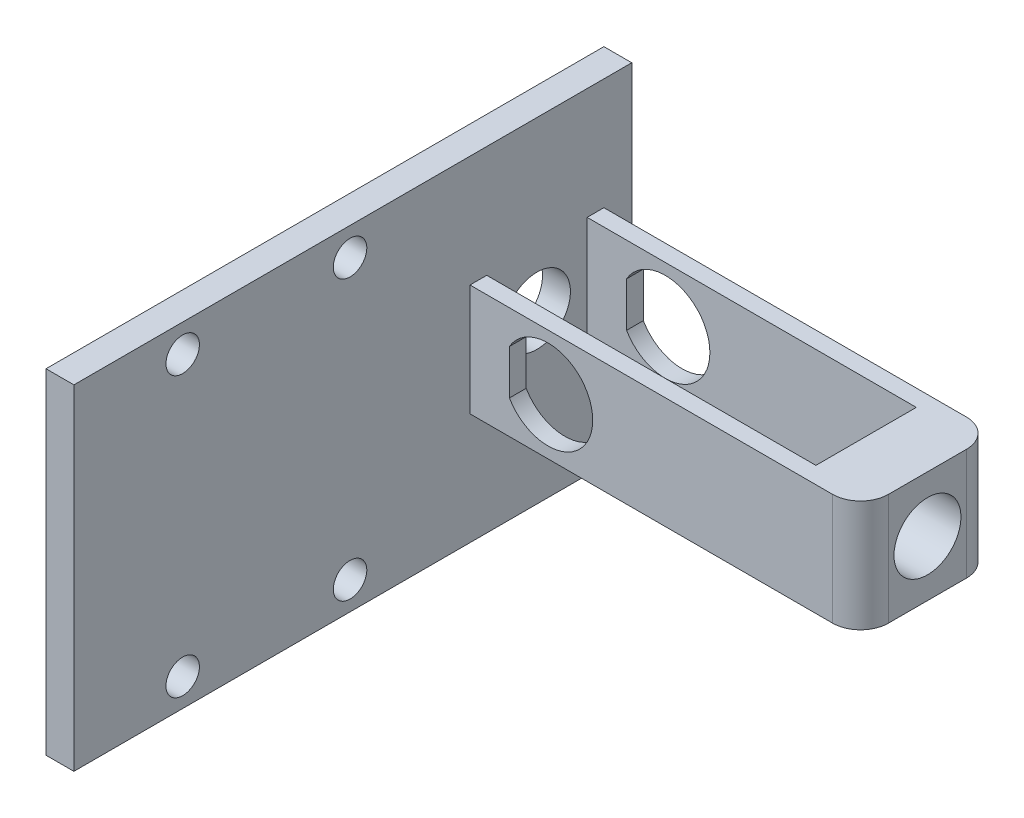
ISO-10303-21;
HEADER;
FILE_DESCRIPTION(('STEP AP214'),'2;1');
FILE_NAME('part.step','',(''),(''),'','','');
FILE_SCHEMA(('AUTOMOTIVE_DESIGN { 1 0 10303 214 1 1 1 1 }'));
ENDSEC;
DATA;
#1=APPLICATION_CONTEXT('core data for automotive mechanical design processes');
#2=APPLICATION_PROTOCOL_DEFINITION('international standard','automotive_design',2000,#1);
#3=PRODUCT_CONTEXT('',#1,'mechanical');
#4=PRODUCT('Part','Part','',(#3));
#5=PRODUCT_RELATED_PRODUCT_CATEGORY('part','',(#4));
#6=PRODUCT_DEFINITION_FORMATION('','',#4);
#7=PRODUCT_DEFINITION_CONTEXT('part definition',#1,'design');
#8=PRODUCT_DEFINITION('design','',#6,#7);
#9=PRODUCT_DEFINITION_SHAPE('','',#8);
#10=(LENGTH_UNIT() NAMED_UNIT(*) SI_UNIT(.MILLI.,.METRE.));
#11=(NAMED_UNIT(*) PLANE_ANGLE_UNIT() SI_UNIT($,.RADIAN.));
#12=(NAMED_UNIT(*) SI_UNIT($,.STERADIAN.) SOLID_ANGLE_UNIT());
#13=UNCERTAINTY_MEASURE_WITH_UNIT(LENGTH_MEASURE(1.E-05),#10,'distance_accuracy_value','');
#14=(GEOMETRIC_REPRESENTATION_CONTEXT(3) GLOBAL_UNCERTAINTY_ASSIGNED_CONTEXT((#13)) GLOBAL_UNIT_ASSIGNED_CONTEXT((#10,
#11,#12)) REPRESENTATION_CONTEXT('',''));
#15=CARTESIAN_POINT('',(0.,0.,0.));
#16=DIRECTION('',(0.,0.,1.));
#17=DIRECTION('',(1.,0.,0.));
#18=AXIS2_PLACEMENT_3D('',#15,#16,#17);
#19=CARTESIAN_POINT('',(35.,-10.,24.));
#20=DIRECTION('',(-1.,0.,0.));
#21=DIRECTION('',(0.,0.,1.));
#22=AXIS2_PLACEMENT_3D('',#19,#20,#21);
#23=PLANE('',#22);
#24=CARTESIAN_POINT('',(35.,0.,12.));
#25=DIRECTION('',(-1.,0.,0.));
#26=DIRECTION('',(0.,0.,1.));
#27=AXIS2_PLACEMENT_3D('',#24,#25,#26);
#28=CIRCLE('',#27,5.99999999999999);
#29=CARTESIAN_POINT('',(35.,0.,18.));
#30=VERTEX_POINT('',#29);
#31=EDGE_CURVE('E197',#30,#30,#28,.T.);
#32=ORIENTED_EDGE('',*,*,#31,.T.);
#33=EDGE_LOOP('',(#32));
#34=FACE_BOUND('',#33,.T.);
#35=DIRECTION('',(0.,0.,-1.));
#36=VECTOR('',#35,1.);
#37=CARTESIAN_POINT('',(35.,-10.,24.));
#38=LINE('',#37,#36);
#39=CARTESIAN_POINT('',(35.,-10.,19.));
#40=VERTEX_POINT('',#39);
#41=CARTESIAN_POINT('',(35.,-10.,5.));
#42=VERTEX_POINT('',#41);
#43=EDGE_CURVE('E276',#40,#42,#38,.T.);
#44=ORIENTED_EDGE('',*,*,#43,.T.);
#45=DIRECTION('',(0.,1.,0.));
#46=VECTOR('',#45,1.);
#47=CARTESIAN_POINT('',(35.,10.,5.));
#48=LINE('',#47,#46);
#49=CARTESIAN_POINT('',(35.,10.,5.));
#50=VERTEX_POINT('',#49);
#51=EDGE_CURVE('E297',#42,#50,#48,.T.);
#52=ORIENTED_EDGE('',*,*,#51,.T.);
#53=DIRECTION('',(0.,0.,-1.));
#54=VECTOR('',#53,1.);
#55=CARTESIAN_POINT('',(35.,10.,24.));
#56=LINE('',#55,#54);
#57=CARTESIAN_POINT('',(35.,10.,19.));
#58=VERTEX_POINT('',#57);
#59=EDGE_CURVE('E292',#58,#50,#56,.T.);
#60=ORIENTED_EDGE('',*,*,#59,.F.);
#61=DIRECTION('',(0.,1.,0.));
#62=VECTOR('',#61,1.);
#63=CARTESIAN_POINT('',(35.,-10.,19.));
#64=LINE('',#63,#62);
#65=EDGE_CURVE('E295',#58,#40,#64,.F.);
#66=ORIENTED_EDGE('',*,*,#65,.T.);
#67=EDGE_LOOP('',(#44,#52,#60,#66));
#68=FACE_BOUND('',#67,.T.);
#69=ADVANCED_FACE('F37',(#34,#68),#23,.F.);
#70=CARTESIAN_POINT('',(-35.,10.,24.));
#71=DIRECTION('',(0.,-1.,0.));
#72=DIRECTION('',(0.,0.,-1.));
#73=AXIS2_PLACEMENT_3D('',#70,#71,#72);
#74=PLANE('',#73);
#75=ORIENTED_EDGE('',*,*,#59,.T.);
#76=CARTESIAN_POINT('',(30.,10.,5.));
#77=DIRECTION('',(0.,-1.,0.));
#78=DIRECTION('',(0.,0.,-1.));
#79=AXIS2_PLACEMENT_3D('',#76,#77,#78);
#80=CIRCLE('',#79,5.);
#81=CARTESIAN_POINT('',(30.,10.,0.));
#82=VERTEX_POINT('',#81);
#83=EDGE_CURVE('E302',#50,#82,#80,.F.);
#84=ORIENTED_EDGE('',*,*,#83,.T.);
#85=DIRECTION('',(-1.,0.,0.));
#86=VECTOR('',#85,1.);
#87=CARTESIAN_POINT('',(-35.,10.,0.));
#88=LINE('',#87,#86);
#89=CARTESIAN_POINT('',(-35.,10.,0.));
#90=VERTEX_POINT('',#89);
#91=EDGE_CURVE('E257',#82,#90,#88,.T.);
#92=ORIENTED_EDGE('',*,*,#91,.T.);
#93=DIRECTION('',(0.,0.,-1.));
#94=VECTOR('',#93,1.);
#95=CARTESIAN_POINT('',(-35.,10.,24.));
#96=LINE('',#95,#94);
#97=CARTESIAN_POINT('',(-35.,10.,3.));
#98=VERTEX_POINT('',#97);
#99=EDGE_CURVE('E289',#98,#90,#96,.T.);
#100=ORIENTED_EDGE('',*,*,#99,.F.);
#101=DIRECTION('',(-1.,0.,0.));
#102=VECTOR('',#101,1.);
#103=CARTESIAN_POINT('',(24.,10.,3.));
#104=LINE('',#103,#102);
#105=CARTESIAN_POINT('',(24.,10.,3.));
#106=VERTEX_POINT('',#105);
#107=EDGE_CURVE('E254',#106,#98,#104,.T.);
#108=ORIENTED_EDGE('',*,*,#107,.F.);
#109=DIRECTION('',(0.,0.,-1.));
#110=VECTOR('',#109,1.);
#111=CARTESIAN_POINT('',(24.,10.,3.));
#112=LINE('',#111,#110);
#113=CARTESIAN_POINT('',(24.,10.,21.));
#114=VERTEX_POINT('',#113);
#115=EDGE_CURVE('E246',#114,#106,#112,.T.);
#116=ORIENTED_EDGE('',*,*,#115,.F.);
#117=DIRECTION('',(-1.,0.,0.));
#118=VECTOR('',#117,1.);
#119=CARTESIAN_POINT('',(24.,10.,21.));
#120=LINE('',#119,#118);
#121=CARTESIAN_POINT('',(-35.,10.,21.));
#122=VERTEX_POINT('',#121);
#123=EDGE_CURVE('E258',#114,#122,#120,.T.);
#124=ORIENTED_EDGE('',*,*,#123,.T.);
#125=CARTESIAN_POINT('',(-35.,10.,24.));
#126=VERTEX_POINT('',#125);
#127=EDGE_CURVE('E290',#126,#122,#96,.T.);
#128=ORIENTED_EDGE('',*,*,#127,.F.);
#129=DIRECTION('',(-1.,0.,0.));
#130=VECTOR('',#129,1.);
#131=CARTESIAN_POINT('',(-35.,10.,24.));
#132=LINE('',#131,#130);
#133=CARTESIAN_POINT('',(30.,10.,24.));
#134=VERTEX_POINT('',#133);
#135=EDGE_CURVE('E266',#134,#126,#132,.T.);
#136=ORIENTED_EDGE('',*,*,#135,.F.);
#137=CARTESIAN_POINT('',(30.,10.,19.));
#138=DIRECTION('',(0.,-1.,0.));
#139=DIRECTION('',(0.,0.,-1.));
#140=AXIS2_PLACEMENT_3D('',#137,#138,#139);
#141=CIRCLE('',#140,5.);
#142=EDGE_CURVE('E300',#134,#58,#141,.F.);
#143=ORIENTED_EDGE('',*,*,#142,.T.);
#144=EDGE_LOOP('',(#75,#84,#92,#100,#108,#116,#124,#128,#136,#143));
#145=FACE_BOUND('',#144,.T.);
#146=ADVANCED_FACE('F324',(#145),#74,.F.);
#147=CARTESIAN_POINT('',(-35.,-10.,24.));
#148=DIRECTION('',(0.,1.,0.));
#149=DIRECTION('',(0.,0.,1.));
#150=AXIS2_PLACEMENT_3D('',#147,#148,#149);
#151=PLANE('',#150);
#152=DIRECTION('',(1.,0.,0.));
#153=VECTOR('',#152,1.);
#154=CARTESIAN_POINT('',(-35.,-10.,0.));
#155=LINE('',#154,#153);
#156=CARTESIAN_POINT('',(-35.,-10.,0.));
#157=VERTEX_POINT('',#156);
#158=CARTESIAN_POINT('',(30.,-10.,0.));
#159=VERTEX_POINT('',#158);
#160=EDGE_CURVE('E270',#157,#159,#155,.T.);
#161=ORIENTED_EDGE('',*,*,#160,.T.);
#162=CARTESIAN_POINT('',(30.,-10.,5.));
#163=DIRECTION('',(0.,1.,0.));
#164=DIRECTION('',(0.,0.,1.));
#165=AXIS2_PLACEMENT_3D('',#162,#163,#164);
#166=CIRCLE('',#165,5.);
#167=EDGE_CURVE('E308',#159,#42,#166,.F.);
#168=ORIENTED_EDGE('',*,*,#167,.T.);
#169=ORIENTED_EDGE('',*,*,#43,.F.);
#170=CARTESIAN_POINT('',(30.,-10.,19.));
#171=DIRECTION('',(0.,1.,0.));
#172=DIRECTION('',(0.,0.,1.));
#173=AXIS2_PLACEMENT_3D('',#170,#171,#172);
#174=CIRCLE('',#173,5.);
#175=CARTESIAN_POINT('',(30.,-10.,24.));
#176=VERTEX_POINT('',#175);
#177=EDGE_CURVE('E306',#40,#176,#174,.F.);
#178=ORIENTED_EDGE('',*,*,#177,.T.);
#179=DIRECTION('',(1.,0.,0.));
#180=VECTOR('',#179,1.);
#181=CARTESIAN_POINT('',(-35.,-10.,24.));
#182=LINE('',#181,#180);
#183=CARTESIAN_POINT('',(-35.,-10.,24.));
#184=VERTEX_POINT('',#183);
#185=EDGE_CURVE('E273',#184,#176,#182,.T.);
#186=ORIENTED_EDGE('',*,*,#185,.F.);
#187=DIRECTION('',(0.,0.,-1.));
#188=VECTOR('',#187,1.);
#189=CARTESIAN_POINT('',(-35.,-10.,24.));
#190=LINE('',#189,#188);
#191=CARTESIAN_POINT('',(-35.,-10.,21.));
#192=VERTEX_POINT('',#191);
#193=EDGE_CURVE('E286',#184,#192,#190,.T.);
#194=ORIENTED_EDGE('',*,*,#193,.T.);
#195=DIRECTION('',(-1.,0.,0.));
#196=VECTOR('',#195,1.);
#197=CARTESIAN_POINT('',(24.,-10.,21.));
#198=LINE('',#197,#196);
#199=CARTESIAN_POINT('',(24.,-10.,21.));
#200=VERTEX_POINT('',#199);
#201=EDGE_CURVE('E261',#200,#192,#198,.T.);
#202=ORIENTED_EDGE('',*,*,#201,.F.);
#203=DIRECTION('',(0.,0.,1.));
#204=VECTOR('',#203,1.);
#205=CARTESIAN_POINT('',(24.,-10.,3.));
#206=LINE('',#205,#204);
#207=CARTESIAN_POINT('',(24.,-10.,3.));
#208=VERTEX_POINT('',#207);
#209=EDGE_CURVE('E239',#208,#200,#206,.T.);
#210=ORIENTED_EDGE('',*,*,#209,.F.);
#211=DIRECTION('',(-1.,0.,0.));
#212=VECTOR('',#211,1.);
#213=CARTESIAN_POINT('',(24.,-10.,3.));
#214=LINE('',#213,#212);
#215=CARTESIAN_POINT('',(-35.,-10.,3.));
#216=VERTEX_POINT('',#215);
#217=EDGE_CURVE('E249',#208,#216,#214,.T.);
#218=ORIENTED_EDGE('',*,*,#217,.T.);
#219=EDGE_CURVE('E285',#216,#157,#190,.T.);
#220=ORIENTED_EDGE('',*,*,#219,.T.);
#221=EDGE_LOOP('',(#161,#168,#169,#178,#186,#194,#202,#210,#218,#220));
#222=FACE_BOUND('',#221,.T.);
#223=ADVANCED_FACE('F332',(#222),#151,.F.);
#224=CARTESIAN_POINT('',(0.,0.,24.));
#225=DIRECTION('',(0.,0.,-1.));
#226=DIRECTION('',(-1.,0.,0.));
#227=AXIS2_PLACEMENT_3D('',#224,#225,#226);
#228=PLANE('',#227);
#229=DIRECTION('',(0.,-1.,0.));
#230=VECTOR('',#229,1.);
#231=CARTESIAN_POINT('',(-27.9282032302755,4.,24.));
#232=LINE('',#231,#230);
#233=CARTESIAN_POINT('',(-27.9282032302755,4.,24.));
#234=VERTEX_POINT('',#233);
#235=CARTESIAN_POINT('',(-27.9282032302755,-4.,24.));
#236=VERTEX_POINT('',#235);
#237=EDGE_CURVE('E169',#234,#236,#232,.T.);
#238=ORIENTED_EDGE('',*,*,#237,.F.);
#239=CARTESIAN_POINT('',(-21.,0.,24.));
#240=DIRECTION('',(0.,0.,1.));
#241=DIRECTION('',(1.,0.,0.));
#242=AXIS2_PLACEMENT_3D('',#239,#240,#241);
#243=CIRCLE('',#242,8.);
#244=EDGE_CURVE('E52',#236,#234,#243,.T.);
#245=ORIENTED_EDGE('',*,*,#244,.F.);
#246=EDGE_LOOP('',(#238,#245));
#247=FACE_BOUND('',#246,.T.);
#248=ORIENTED_EDGE('',*,*,#185,.T.);
#249=DIRECTION('',(0.,1.,0.));
#250=VECTOR('',#249,1.);
#251=CARTESIAN_POINT('',(30.,0.,24.));
#252=LINE('',#251,#250);
#253=EDGE_CURVE('E310',#176,#134,#252,.T.);
#254=ORIENTED_EDGE('',*,*,#253,.T.);
#255=ORIENTED_EDGE('',*,*,#135,.T.);
#256=DIRECTION('',(0.,-1.,0.));
#257=VECTOR('',#256,1.);
#258=CARTESIAN_POINT('',(-35.,-10.,24.));
#259=LINE('',#258,#257);
#260=EDGE_CURVE('E269',#126,#184,#259,.T.);
#261=ORIENTED_EDGE('',*,*,#260,.T.);
#262=EDGE_LOOP('',(#248,#254,#255,#261));
#263=FACE_BOUND('',#262,.T.);
#264=ADVANCED_FACE('F174',(#247,#263),#228,.F.);
#265=CARTESIAN_POINT('',(0.,0.,0.));
#266=DIRECTION('',(0.,0.,-1.));
#267=DIRECTION('',(-1.,0.,0.));
#268=AXIS2_PLACEMENT_3D('',#265,#266,#267);
#269=PLANE('',#268);
#270=CARTESIAN_POINT('',(-21.,0.,0.));
#271=DIRECTION('',(0.,0.,-1.));
#272=DIRECTION('',(-1.,0.,0.));
#273=AXIS2_PLACEMENT_3D('',#270,#271,#272);
#274=CIRCLE('',#273,8.);
#275=CARTESIAN_POINT('',(-27.9282032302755,4.,0.));
#276=VERTEX_POINT('',#275);
#277=CARTESIAN_POINT('',(-27.9282032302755,-4.,0.));
#278=VERTEX_POINT('',#277);
#279=EDGE_CURVE('E192',#276,#278,#274,.T.);
#280=ORIENTED_EDGE('',*,*,#279,.F.);
#281=DIRECTION('',(0.,1.,0.));
#282=VECTOR('',#281,1.);
#283=CARTESIAN_POINT('',(-27.9282032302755,0.,0.));
#284=LINE('',#283,#282);
#285=EDGE_CURVE('E187',#278,#276,#284,.T.);
#286=ORIENTED_EDGE('',*,*,#285,.F.);
#287=EDGE_LOOP('',(#280,#286));
#288=FACE_BOUND('',#287,.T.);
#289=ORIENTED_EDGE('',*,*,#91,.F.);
#290=DIRECTION('',(0.,1.,0.));
#291=VECTOR('',#290,1.);
#292=CARTESIAN_POINT('',(30.,-10.,0.));
#293=LINE('',#292,#291);
#294=EDGE_CURVE('E304',#82,#159,#293,.F.);
#295=ORIENTED_EDGE('',*,*,#294,.T.);
#296=ORIENTED_EDGE('',*,*,#160,.F.);
#297=DIRECTION('',(0.,-1.,0.));
#298=VECTOR('',#297,1.);
#299=CARTESIAN_POINT('',(-35.,-10.,0.));
#300=LINE('',#299,#298);
#301=EDGE_CURVE('E279',#90,#157,#300,.T.);
#302=ORIENTED_EDGE('',*,*,#301,.F.);
#303=EDGE_LOOP('',(#289,#295,#296,#302));
#304=FACE_BOUND('',#303,.T.);
#305=ADVANCED_FACE('F350',(#288,#304),#269,.T.);
#306=CARTESIAN_POINT('',(24.,10.,3.));
#307=DIRECTION('',(0.,0.,-1.));
#308=DIRECTION('',(0.,1.,0.));
#309=AXIS2_PLACEMENT_3D('',#306,#307,#308);
#310=PLANE('',#309);
#311=DIRECTION('',(0.,1.,0.));
#312=VECTOR('',#311,1.);
#313=CARTESIAN_POINT('',(-27.9282032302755,10.,3.));
#314=LINE('',#313,#312);
#315=CARTESIAN_POINT('',(-27.9282032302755,-4.,3.));
#316=VERTEX_POINT('',#315);
#317=CARTESIAN_POINT('',(-27.9282032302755,4.,3.));
#318=VERTEX_POINT('',#317);
#319=EDGE_CURVE('E184',#316,#318,#314,.T.);
#320=ORIENTED_EDGE('',*,*,#319,.T.);
#321=CARTESIAN_POINT('',(-21.,0.,3.));
#322=DIRECTION('',(0.,0.,-1.));
#323=DIRECTION('',(0.,1.,0.));
#324=AXIS2_PLACEMENT_3D('',#321,#322,#323);
#325=CIRCLE('',#324,8.);
#326=EDGE_CURVE('E189',#318,#316,#325,.T.);
#327=ORIENTED_EDGE('',*,*,#326,.T.);
#328=EDGE_LOOP('',(#320,#327));
#329=FACE_BOUND('',#328,.T.);
#330=DIRECTION('',(0.,-1.,0.));
#331=VECTOR('',#330,1.);
#332=CARTESIAN_POINT('',(-35.,10.,3.));
#333=LINE('',#332,#331);
#334=EDGE_CURVE('E236',#98,#216,#333,.T.);
#335=ORIENTED_EDGE('',*,*,#334,.T.);
#336=ORIENTED_EDGE('',*,*,#217,.F.);
#337=DIRECTION('',(0.,-1.,0.));
#338=VECTOR('',#337,1.);
#339=CARTESIAN_POINT('',(24.,10.,3.));
#340=LINE('',#339,#338);
#341=EDGE_CURVE('E237',#106,#208,#340,.T.);
#342=ORIENTED_EDGE('',*,*,#341,.F.);
#343=ORIENTED_EDGE('',*,*,#107,.T.);
#344=EDGE_LOOP('',(#335,#336,#342,#343));
#345=FACE_BOUND('',#344,.T.);
#346=ADVANCED_FACE('F317',(#329,#345),#310,.F.);
#347=CARTESIAN_POINT('',(24.,10.,21.));
#348=DIRECTION('',(0.,0.,1.));
#349=DIRECTION('',(0.,-1.,0.));
#350=AXIS2_PLACEMENT_3D('',#347,#348,#349);
#351=PLANE('',#350);
#352=DIRECTION('',(0.,-1.,0.));
#353=VECTOR('',#352,1.);
#354=CARTESIAN_POINT('',(-27.9282032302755,10.,21.));
#355=LINE('',#354,#353);
#356=CARTESIAN_POINT('',(-27.9282032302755,4.,21.));
#357=VERTEX_POINT('',#356);
#358=CARTESIAN_POINT('',(-27.9282032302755,-4.,21.));
#359=VERTEX_POINT('',#358);
#360=EDGE_CURVE('E45',#357,#359,#355,.T.);
#361=ORIENTED_EDGE('',*,*,#360,.T.);
#362=CARTESIAN_POINT('',(-21.,0.,21.));
#363=DIRECTION('',(0.,0.,1.));
#364=DIRECTION('',(0.,-1.,0.));
#365=AXIS2_PLACEMENT_3D('',#362,#363,#364);
#366=CIRCLE('',#365,8.);
#367=EDGE_CURVE('E11',#359,#357,#366,.T.);
#368=ORIENTED_EDGE('',*,*,#367,.T.);
#369=EDGE_LOOP('',(#361,#368));
#370=FACE_BOUND('',#369,.T.);
#371=DIRECTION('',(0.,1.,0.));
#372=VECTOR('',#371,1.);
#373=CARTESIAN_POINT('',(-35.,10.,21.));
#374=LINE('',#373,#372);
#375=EDGE_CURVE('E240',#192,#122,#374,.T.);
#376=ORIENTED_EDGE('',*,*,#375,.T.);
#377=ORIENTED_EDGE('',*,*,#123,.F.);
#378=DIRECTION('',(0.,1.,0.));
#379=VECTOR('',#378,1.);
#380=CARTESIAN_POINT('',(24.,10.,21.));
#381=LINE('',#380,#379);
#382=EDGE_CURVE('E243',#200,#114,#381,.T.);
#383=ORIENTED_EDGE('',*,*,#382,.F.);
#384=ORIENTED_EDGE('',*,*,#201,.T.);
#385=EDGE_LOOP('',(#376,#377,#383,#384));
#386=FACE_BOUND('',#385,.T.);
#387=ADVANCED_FACE('F313',(#370,#386),#351,.F.);
#388=CARTESIAN_POINT('',(24.,0.,0.));
#389=DIRECTION('',(-1.,0.,0.));
#390=DIRECTION('',(0.,0.,1.));
#391=AXIS2_PLACEMENT_3D('',#388,#389,#390);
#392=PLANE('',#391);
#393=CARTESIAN_POINT('',(24.,0.,12.));
#394=DIRECTION('',(-1.,0.,0.));
#395=DIRECTION('',(0.,0.,1.));
#396=AXIS2_PLACEMENT_3D('',#393,#394,#395);
#397=CIRCLE('',#396,5.99999999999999);
#398=CARTESIAN_POINT('',(24.,0.,18.));
#399=VERTEX_POINT('',#398);
#400=EDGE_CURVE('E203',#399,#399,#397,.T.);
#401=ORIENTED_EDGE('',*,*,#400,.F.);
#402=EDGE_LOOP('',(#401));
#403=FACE_BOUND('',#402,.T.);
#404=ORIENTED_EDGE('',*,*,#341,.T.);
#405=ORIENTED_EDGE('',*,*,#209,.T.);
#406=ORIENTED_EDGE('',*,*,#382,.T.);
#407=ORIENTED_EDGE('',*,*,#115,.T.);
#408=EDGE_LOOP('',(#404,#405,#406,#407));
#409=FACE_BOUND('',#408,.T.);
#410=ADVANCED_FACE('F316',(#403,#409),#392,.T.);
#411=CARTESIAN_POINT('',(30.,-10.,5.));
#412=DIRECTION('',(0.,-1.,0.));
#413=DIRECTION('',(0.,0.,-1.));
#414=AXIS2_PLACEMENT_3D('',#411,#412,#413);
#415=CYLINDRICAL_SURFACE('',#414,5.);
#416=ORIENTED_EDGE('',*,*,#167,.F.);
#417=ORIENTED_EDGE('',*,*,#294,.F.);
#418=ORIENTED_EDGE('',*,*,#83,.F.);
#419=ORIENTED_EDGE('',*,*,#51,.F.);
#420=EDGE_LOOP('',(#416,#417,#418,#419));
#421=FACE_BOUND('',#420,.T.);
#422=ADVANCED_FACE('F345',(#421),#415,.T.);
#423=CARTESIAN_POINT('',(30.,0.,19.));
#424=DIRECTION('',(0.,1.,0.));
#425=DIRECTION('',(0.,0.,1.));
#426=AXIS2_PLACEMENT_3D('',#423,#424,#425);
#427=CYLINDRICAL_SURFACE('',#426,5.);
#428=ORIENTED_EDGE('',*,*,#177,.F.);
#429=ORIENTED_EDGE('',*,*,#65,.F.);
#430=ORIENTED_EDGE('',*,*,#142,.F.);
#431=ORIENTED_EDGE('',*,*,#253,.F.);
#432=EDGE_LOOP('',(#428,#429,#430,#431));
#433=FACE_BOUND('',#432,.T.);
#434=ADVANCED_FACE('F39',(#433),#427,.T.);
#435=CARTESIAN_POINT('',(-35.,0.,0.));
#436=DIRECTION('',(-1.,0.,0.));
#437=DIRECTION('',(0.,0.,1.));
#438=AXIS2_PLACEMENT_3D('',#435,#436,#437);
#439=PLANE('',#438);
#440=CARTESIAN_POINT('',(-35.,-25.,45.5));
#441=DIRECTION('',(-1.,0.,0.));
#442=DIRECTION('',(0.,0.,1.));
#443=AXIS2_PLACEMENT_3D('',#440,#441,#442);
#444=CIRCLE('',#443,3.);
#445=CARTESIAN_POINT('',(-35.,-25.,48.5));
#446=VERTEX_POINT('',#445);
#447=EDGE_CURVE('E440',#446,#446,#444,.T.);
#448=ORIENTED_EDGE('',*,*,#447,.T.);
#449=EDGE_LOOP('',(#448));
#450=FACE_BOUND('',#449,.T.);
#451=CARTESIAN_POINT('',(-35.,-25.,75.5));
#452=DIRECTION('',(-1.,0.,0.));
#453=DIRECTION('',(0.,0.,1.));
#454=AXIS2_PLACEMENT_3D('',#451,#452,#453);
#455=CIRCLE('',#454,3.);
#456=CARTESIAN_POINT('',(-35.,-25.,78.5));
#457=VERTEX_POINT('',#456);
#458=EDGE_CURVE('E450',#457,#457,#455,.T.);
#459=ORIENTED_EDGE('',*,*,#458,.T.);
#460=EDGE_LOOP('',(#459));
#461=FACE_BOUND('',#460,.T.);
#462=CARTESIAN_POINT('',(-35.,25.,75.5));
#463=DIRECTION('',(-1.,0.,0.));
#464=DIRECTION('',(0.,0.,1.));
#465=AXIS2_PLACEMENT_3D('',#462,#463,#464);
#466=CIRCLE('',#465,3.);
#467=CARTESIAN_POINT('',(-35.,25.,78.5));
#468=VERTEX_POINT('',#467);
#469=EDGE_CURVE('E456',#468,#468,#466,.T.);
#470=ORIENTED_EDGE('',*,*,#469,.T.);
#471=EDGE_LOOP('',(#470));
#472=FACE_BOUND('',#471,.T.);
#473=CARTESIAN_POINT('',(-35.,25.,45.5));
#474=DIRECTION('',(-1.,0.,0.));
#475=DIRECTION('',(0.,0.,1.));
#476=AXIS2_PLACEMENT_3D('',#473,#474,#475);
#477=CIRCLE('',#476,3.);
#478=CARTESIAN_POINT('',(-35.,25.,48.5));
#479=VERTEX_POINT('',#478);
#480=EDGE_CURVE('E176',#479,#479,#477,.T.);
#481=ORIENTED_EDGE('',*,*,#480,.T.);
#482=EDGE_LOOP('',(#481));
#483=FACE_BOUND('',#482,.T.);
#484=CARTESIAN_POINT('',(-35.,0.,12.));
#485=DIRECTION('',(-1.,0.,0.));
#486=DIRECTION('',(0.,0.,1.));
#487=AXIS2_PLACEMENT_3D('',#484,#485,#486);
#488=CIRCLE('',#487,5.99999999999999);
#489=CARTESIAN_POINT('',(-35.,0.,18.));
#490=VERTEX_POINT('',#489);
#491=EDGE_CURVE('E200',#490,#490,#488,.T.);
#492=ORIENTED_EDGE('',*,*,#491,.T.);
#493=EDGE_LOOP('',(#492));
#494=FACE_BOUND('',#493,.T.);
#495=ORIENTED_EDGE('',*,*,#301,.T.);
#496=ORIENTED_EDGE('',*,*,#219,.F.);
#497=ORIENTED_EDGE('',*,*,#334,.F.);
#498=ORIENTED_EDGE('',*,*,#99,.T.);
#499=EDGE_LOOP('',(#495,#496,#497,#498));
#500=FACE_BOUND('',#499,.T.);
#501=DIRECTION('',(0.,-1.,0.));
#502=VECTOR('',#501,1.);
#503=CARTESIAN_POINT('',(-35.,30.,-5.));
#504=LINE('',#503,#502);
#505=CARTESIAN_POINT('',(-35.,30.,-5.));
#506=VERTEX_POINT('',#505);
#507=CARTESIAN_POINT('',(-35.,-30.,-5.));
#508=VERTEX_POINT('',#507);
#509=EDGE_CURVE('E206',#506,#508,#504,.T.);
#510=ORIENTED_EDGE('',*,*,#509,.F.);
#511=DIRECTION('',(0.,0.,-1.));
#512=VECTOR('',#511,1.);
#513=CARTESIAN_POINT('',(-35.,30.,-5.));
#514=LINE('',#513,#512);
#515=CARTESIAN_POINT('',(-35.,30.,95.));
#516=VERTEX_POINT('',#515);
#517=EDGE_CURVE('E211',#516,#506,#514,.T.);
#518=ORIENTED_EDGE('',*,*,#517,.F.);
#519=DIRECTION('',(0.,1.,0.));
#520=VECTOR('',#519,1.);
#521=CARTESIAN_POINT('',(-35.,30.,95.));
#522=LINE('',#521,#520);
#523=CARTESIAN_POINT('',(-35.,-30.,95.));
#524=VERTEX_POINT('',#523);
#525=EDGE_CURVE('E222',#524,#516,#522,.T.);
#526=ORIENTED_EDGE('',*,*,#525,.F.);
#527=DIRECTION('',(0.,0.,1.));
#528=VECTOR('',#527,1.);
#529=CARTESIAN_POINT('',(-35.,-30.,-5.));
#530=LINE('',#529,#528);
#531=EDGE_CURVE('E220',#508,#524,#530,.T.);
#532=ORIENTED_EDGE('',*,*,#531,.F.);
#533=EDGE_LOOP('',(#510,#518,#526,#532));
#534=FACE_BOUND('',#533,.T.);
#535=ORIENTED_EDGE('',*,*,#193,.F.);
#536=ORIENTED_EDGE('',*,*,#260,.F.);
#537=ORIENTED_EDGE('',*,*,#127,.T.);
#538=ORIENTED_EDGE('',*,*,#375,.F.);
#539=EDGE_LOOP('',(#535,#536,#537,#538));
#540=FACE_BOUND('',#539,.T.);
#541=ADVANCED_FACE('F334',(#450,#461,#472,#483,#494,#500,#534,#540),#439,.F.);
#542=CARTESIAN_POINT('',(-40.,30.,-5.));
#543=DIRECTION('',(0.,0.,1.));
#544=DIRECTION('',(1.,0.,0.));
#545=AXIS2_PLACEMENT_3D('',#542,#543,#544);
#546=PLANE('',#545);
#547=ORIENTED_EDGE('',*,*,#509,.T.);
#548=DIRECTION('',(1.,0.,0.));
#549=VECTOR('',#548,1.);
#550=CARTESIAN_POINT('',(-40.,-30.,-5.));
#551=LINE('',#550,#549);
#552=CARTESIAN_POINT('',(-40.,-30.,-5.));
#553=VERTEX_POINT('',#552);
#554=EDGE_CURVE('E233',#553,#508,#551,.T.);
#555=ORIENTED_EDGE('',*,*,#554,.F.);
#556=DIRECTION('',(0.,-1.,0.));
#557=VECTOR('',#556,1.);
#558=CARTESIAN_POINT('',(-40.,30.,-5.));
#559=LINE('',#558,#557);
#560=CARTESIAN_POINT('',(-40.,30.,-5.));
#561=VERTEX_POINT('',#560);
#562=EDGE_CURVE('E207',#561,#553,#559,.T.);
#563=ORIENTED_EDGE('',*,*,#562,.F.);
#564=DIRECTION('',(1.,0.,0.));
#565=VECTOR('',#564,1.);
#566=CARTESIAN_POINT('',(-40.,30.,-5.));
#567=LINE('',#566,#565);
#568=EDGE_CURVE('E217',#561,#506,#567,.T.);
#569=ORIENTED_EDGE('',*,*,#568,.T.);
#570=EDGE_LOOP('',(#547,#555,#563,#569));
#571=FACE_BOUND('',#570,.T.);
#572=ADVANCED_FACE('F386',(#571),#546,.F.);
#573=CARTESIAN_POINT('',(-40.,-30.,-5.));
#574=DIRECTION('',(0.,1.,0.));
#575=DIRECTION('',(0.,0.,1.));
#576=AXIS2_PLACEMENT_3D('',#573,#574,#575);
#577=PLANE('',#576);
#578=ORIENTED_EDGE('',*,*,#531,.T.);
#579=DIRECTION('',(1.,0.,0.));
#580=VECTOR('',#579,1.);
#581=CARTESIAN_POINT('',(-40.,-30.,95.));
#582=LINE('',#581,#580);
#583=CARTESIAN_POINT('',(-40.,-30.,95.));
#584=VERTEX_POINT('',#583);
#585=EDGE_CURVE('E230',#584,#524,#582,.T.);
#586=ORIENTED_EDGE('',*,*,#585,.F.);
#587=DIRECTION('',(0.,0.,1.));
#588=VECTOR('',#587,1.);
#589=CARTESIAN_POINT('',(-40.,-30.,-5.));
#590=LINE('',#589,#588);
#591=EDGE_CURVE('E210',#553,#584,#590,.T.);
#592=ORIENTED_EDGE('',*,*,#591,.F.);
#593=ORIENTED_EDGE('',*,*,#554,.T.);
#594=EDGE_LOOP('',(#578,#586,#592,#593));
#595=FACE_BOUND('',#594,.T.);
#596=ADVANCED_FACE('F389',(#595),#577,.F.);
#597=CARTESIAN_POINT('',(-40.,30.,95.));
#598=DIRECTION('',(0.,0.,-1.));
#599=DIRECTION('',(-1.,0.,0.));
#600=AXIS2_PLACEMENT_3D('',#597,#598,#599);
#601=PLANE('',#600);
#602=ORIENTED_EDGE('',*,*,#525,.T.);
#603=DIRECTION('',(1.,0.,0.));
#604=VECTOR('',#603,1.);
#605=CARTESIAN_POINT('',(-40.,30.,95.));
#606=LINE('',#605,#604);
#607=CARTESIAN_POINT('',(-40.,30.,95.));
#608=VERTEX_POINT('',#607);
#609=EDGE_CURVE('E227',#608,#516,#606,.T.);
#610=ORIENTED_EDGE('',*,*,#609,.F.);
#611=DIRECTION('',(0.,1.,0.));
#612=VECTOR('',#611,1.);
#613=CARTESIAN_POINT('',(-40.,30.,95.));
#614=LINE('',#613,#612);
#615=EDGE_CURVE('E213',#584,#608,#614,.T.);
#616=ORIENTED_EDGE('',*,*,#615,.F.);
#617=ORIENTED_EDGE('',*,*,#585,.T.);
#618=EDGE_LOOP('',(#602,#610,#616,#617));
#619=FACE_BOUND('',#618,.T.);
#620=ADVANCED_FACE('F393',(#619),#601,.F.);
#621=CARTESIAN_POINT('',(-40.,30.,-5.));
#622=DIRECTION('',(0.,-1.,0.));
#623=DIRECTION('',(0.,0.,-1.));
#624=AXIS2_PLACEMENT_3D('',#621,#622,#623);
#625=PLANE('',#624);
#626=ORIENTED_EDGE('',*,*,#517,.T.);
#627=ORIENTED_EDGE('',*,*,#568,.F.);
#628=DIRECTION('',(0.,0.,-1.));
#629=VECTOR('',#628,1.);
#630=CARTESIAN_POINT('',(-40.,30.,-5.));
#631=LINE('',#630,#629);
#632=EDGE_CURVE('E215',#608,#561,#631,.T.);
#633=ORIENTED_EDGE('',*,*,#632,.F.);
#634=ORIENTED_EDGE('',*,*,#609,.T.);
#635=EDGE_LOOP('',(#626,#627,#633,#634));
#636=FACE_BOUND('',#635,.T.);
#637=ADVANCED_FACE('F397',(#636),#625,.F.);
#638=CARTESIAN_POINT('',(-40.,0.,0.));
#639=DIRECTION('',(-1.,0.,0.));
#640=DIRECTION('',(0.,0.,1.));
#641=AXIS2_PLACEMENT_3D('',#638,#639,#640);
#642=PLANE('',#641);
#643=CARTESIAN_POINT('',(-40.,-25.,45.5));
#644=DIRECTION('',(-1.,0.,0.));
#645=DIRECTION('',(0.,0.,1.));
#646=AXIS2_PLACEMENT_3D('',#643,#644,#645);
#647=CIRCLE('',#646,3.);
#648=CARTESIAN_POINT('',(-40.,-25.,48.5));
#649=VERTEX_POINT('',#648);
#650=EDGE_CURVE('E443',#649,#649,#647,.T.);
#651=ORIENTED_EDGE('',*,*,#650,.F.);
#652=EDGE_LOOP('',(#651));
#653=FACE_BOUND('',#652,.T.);
#654=CARTESIAN_POINT('',(-40.,-25.,75.5));
#655=DIRECTION('',(-1.,0.,0.));
#656=DIRECTION('',(0.,0.,1.));
#657=AXIS2_PLACEMENT_3D('',#654,#655,#656);
#658=CIRCLE('',#657,3.);
#659=CARTESIAN_POINT('',(-40.,-25.,78.5));
#660=VERTEX_POINT('',#659);
#661=EDGE_CURVE('E445',#660,#660,#658,.T.);
#662=ORIENTED_EDGE('',*,*,#661,.F.);
#663=EDGE_LOOP('',(#662));
#664=FACE_BOUND('',#663,.T.);
#665=CARTESIAN_POINT('',(-40.,25.,75.5));
#666=DIRECTION('',(-1.,0.,0.));
#667=DIRECTION('',(0.,0.,1.));
#668=AXIS2_PLACEMENT_3D('',#665,#666,#667);
#669=CIRCLE('',#668,3.);
#670=CARTESIAN_POINT('',(-40.,25.,78.5));
#671=VERTEX_POINT('',#670);
#672=EDGE_CURVE('E453',#671,#671,#669,.T.);
#673=ORIENTED_EDGE('',*,*,#672,.F.);
#674=EDGE_LOOP('',(#673));
#675=FACE_BOUND('',#674,.T.);
#676=CARTESIAN_POINT('',(-40.,25.,45.5));
#677=DIRECTION('',(-1.,0.,0.));
#678=DIRECTION('',(0.,0.,1.));
#679=AXIS2_PLACEMENT_3D('',#676,#677,#678);
#680=CIRCLE('',#679,3.);
#681=CARTESIAN_POINT('',(-40.,25.,48.5));
#682=VERTEX_POINT('',#681);
#683=EDGE_CURVE('E179',#682,#682,#680,.T.);
#684=ORIENTED_EDGE('',*,*,#683,.F.);
#685=EDGE_LOOP('',(#684));
#686=FACE_BOUND('',#685,.T.);
#687=CARTESIAN_POINT('',(-40.,0.,12.));
#688=DIRECTION('',(-1.,0.,0.));
#689=DIRECTION('',(0.,0.,1.));
#690=AXIS2_PLACEMENT_3D('',#687,#688,#689);
#691=CIRCLE('',#690,5.99999999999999);
#692=CARTESIAN_POINT('',(-40.,0.,18.));
#693=VERTEX_POINT('',#692);
#694=EDGE_CURVE('E194',#693,#693,#691,.T.);
#695=ORIENTED_EDGE('',*,*,#694,.F.);
#696=EDGE_LOOP('',(#695));
#697=FACE_BOUND('',#696,.T.);
#698=ORIENTED_EDGE('',*,*,#562,.T.);
#699=ORIENTED_EDGE('',*,*,#591,.T.);
#700=ORIENTED_EDGE('',*,*,#615,.T.);
#701=ORIENTED_EDGE('',*,*,#632,.T.);
#702=EDGE_LOOP('',(#698,#699,#700,#701));
#703=FACE_BOUND('',#702,.T.);
#704=ADVANCED_FACE('F400',(#653,#664,#675,#686,#697,#703),#642,.T.);
#705=CARTESIAN_POINT('',(35.,0.,12.));
#706=DIRECTION('',(-1.,0.,0.));
#707=DIRECTION('',(0.,0.,1.));
#708=AXIS2_PLACEMENT_3D('',#705,#706,#707);
#709=CYLINDRICAL_SURFACE('',#708,5.99999999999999);
#710=ORIENTED_EDGE('',*,*,#694,.T.);
#711=EDGE_LOOP('',(#710));
#712=FACE_BOUND('',#711,.T.);
#713=ORIENTED_EDGE('',*,*,#491,.F.);
#714=EDGE_LOOP('',(#713));
#715=FACE_BOUND('',#714,.T.);
#716=ADVANCED_FACE('F407',(#712,#715),#709,.F.);
#717=ORIENTED_EDGE('',*,*,#400,.T.);
#718=EDGE_LOOP('',(#717));
#719=FACE_BOUND('',#718,.T.);
#720=ORIENTED_EDGE('',*,*,#31,.F.);
#721=EDGE_LOOP('',(#720));
#722=FACE_BOUND('',#721,.T.);
#723=ADVANCED_FACE('F409',(#719,#722),#709,.F.);
#724=CARTESIAN_POINT('',(-27.9282032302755,4.,-5.));
#725=DIRECTION('',(-1.,0.,0.));
#726=DIRECTION('',(0.,0.,1.));
#727=AXIS2_PLACEMENT_3D('',#724,#725,#726);
#728=PLANE('',#727);
#729=DIRECTION('',(0.,0.,1.));
#730=VECTOR('',#729,1.);
#731=CARTESIAN_POINT('',(-27.9282032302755,4.,-5.));
#732=LINE('',#731,#730);
#733=EDGE_CURVE('E171',#357,#234,#732,.T.);
#734=ORIENTED_EDGE('',*,*,#733,.T.);
#735=ORIENTED_EDGE('',*,*,#237,.T.);
#736=DIRECTION('',(0.,0.,1.));
#737=VECTOR('',#736,1.);
#738=CARTESIAN_POINT('',(-27.9282032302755,-4.,-5.));
#739=LINE('',#738,#737);
#740=EDGE_CURVE('E161',#359,#236,#739,.T.);
#741=ORIENTED_EDGE('',*,*,#740,.F.);
#742=ORIENTED_EDGE('',*,*,#360,.F.);
#743=EDGE_LOOP('',(#734,#735,#741,#742));
#744=FACE_BOUND('',#743,.T.);
#745=ADVANCED_FACE('F170',(#744),#728,.F.);
#746=CARTESIAN_POINT('',(-21.,0.,-5.));
#747=DIRECTION('',(0.,0.,1.));
#748=DIRECTION('',(1.,0.,0.));
#749=AXIS2_PLACEMENT_3D('',#746,#747,#748);
#750=CYLINDRICAL_SURFACE('',#749,8.);
#751=ORIENTED_EDGE('',*,*,#740,.T.);
#752=ORIENTED_EDGE('',*,*,#244,.T.);
#753=ORIENTED_EDGE('',*,*,#733,.F.);
#754=ORIENTED_EDGE('',*,*,#367,.F.);
#755=EDGE_LOOP('',(#751,#752,#753,#754));
#756=FACE_BOUND('',#755,.T.);
#757=ADVANCED_FACE('F163',(#756),#750,.F.);
#758=ORIENTED_EDGE('',*,*,#279,.T.);
#759=EDGE_CURVE('E60',#278,#316,#739,.T.);
#760=ORIENTED_EDGE('',*,*,#759,.T.);
#761=ORIENTED_EDGE('',*,*,#326,.F.);
#762=EDGE_CURVE('E166',#276,#318,#732,.T.);
#763=ORIENTED_EDGE('',*,*,#762,.F.);
#764=EDGE_LOOP('',(#758,#760,#761,#763));
#765=FACE_BOUND('',#764,.T.);
#766=ADVANCED_FACE('F413',(#765),#750,.F.);
#767=ORIENTED_EDGE('',*,*,#285,.T.);
#768=ORIENTED_EDGE('',*,*,#762,.T.);
#769=ORIENTED_EDGE('',*,*,#319,.F.);
#770=ORIENTED_EDGE('',*,*,#759,.F.);
#771=EDGE_LOOP('',(#767,#768,#769,#770));
#772=FACE_BOUND('',#771,.T.);
#773=ADVANCED_FACE('F416',(#772),#728,.F.);
#774=CARTESIAN_POINT('',(-40.,25.,45.5));
#775=DIRECTION('',(-1.,0.,0.));
#776=DIRECTION('',(0.,0.,1.));
#777=AXIS2_PLACEMENT_3D('',#774,#775,#776);
#778=CYLINDRICAL_SURFACE('',#777,3.);
#779=ORIENTED_EDGE('',*,*,#480,.F.);
#780=EDGE_LOOP('',(#779));
#781=FACE_BOUND('',#780,.T.);
#782=ORIENTED_EDGE('',*,*,#683,.T.);
#783=EDGE_LOOP('',(#782));
#784=FACE_BOUND('',#783,.T.);
#785=ADVANCED_FACE('F420',(#781,#784),#778,.F.);
#786=CARTESIAN_POINT('',(-40.,25.,75.5));
#787=DIRECTION('',(-1.,0.,0.));
#788=DIRECTION('',(0.,0.,1.));
#789=AXIS2_PLACEMENT_3D('',#786,#787,#788);
#790=CYLINDRICAL_SURFACE('',#789,3.);
#791=ORIENTED_EDGE('',*,*,#469,.F.);
#792=EDGE_LOOP('',(#791));
#793=FACE_BOUND('',#792,.T.);
#794=ORIENTED_EDGE('',*,*,#672,.T.);
#795=EDGE_LOOP('',(#794));
#796=FACE_BOUND('',#795,.T.);
#797=ADVANCED_FACE('F423',(#793,#796),#790,.F.);
#798=CARTESIAN_POINT('',(-40.,-25.,75.5));
#799=DIRECTION('',(-1.,0.,0.));
#800=DIRECTION('',(0.,0.,1.));
#801=AXIS2_PLACEMENT_3D('',#798,#799,#800);
#802=CYLINDRICAL_SURFACE('',#801,3.);
#803=ORIENTED_EDGE('',*,*,#458,.F.);
#804=EDGE_LOOP('',(#803));
#805=FACE_BOUND('',#804,.T.);
#806=ORIENTED_EDGE('',*,*,#661,.T.);
#807=EDGE_LOOP('',(#806));
#808=FACE_BOUND('',#807,.T.);
#809=ADVANCED_FACE('F427',(#805,#808),#802,.F.);
#810=CARTESIAN_POINT('',(-40.,-25.,45.5));
#811=DIRECTION('',(-1.,0.,0.));
#812=DIRECTION('',(0.,0.,1.));
#813=AXIS2_PLACEMENT_3D('',#810,#811,#812);
#814=CYLINDRICAL_SURFACE('',#813,3.);
#815=ORIENTED_EDGE('',*,*,#447,.F.);
#816=EDGE_LOOP('',(#815));
#817=FACE_BOUND('',#816,.T.);
#818=ORIENTED_EDGE('',*,*,#650,.T.);
#819=EDGE_LOOP('',(#818));
#820=FACE_BOUND('',#819,.T.);
#821=ADVANCED_FACE('F431',(#817,#820),#814,.F.);
#822=CLOSED_SHELL('',(#69,#146,#223,#264,#305,#346,#387,#410,#422,#434,#541,#572,#596,#620,#637,
#704,#716,#723,#745,#757,#766,#773,#785,#797,#809,#821));
#823=MANIFOLD_SOLID_BREP('B2',#822);
#824=ADVANCED_BREP_SHAPE_REPRESENTATION('',(#18,#823),#14);
#825=SHAPE_DEFINITION_REPRESENTATION(#9,#824);
ENDSEC;
END-ISO-10303-21;
